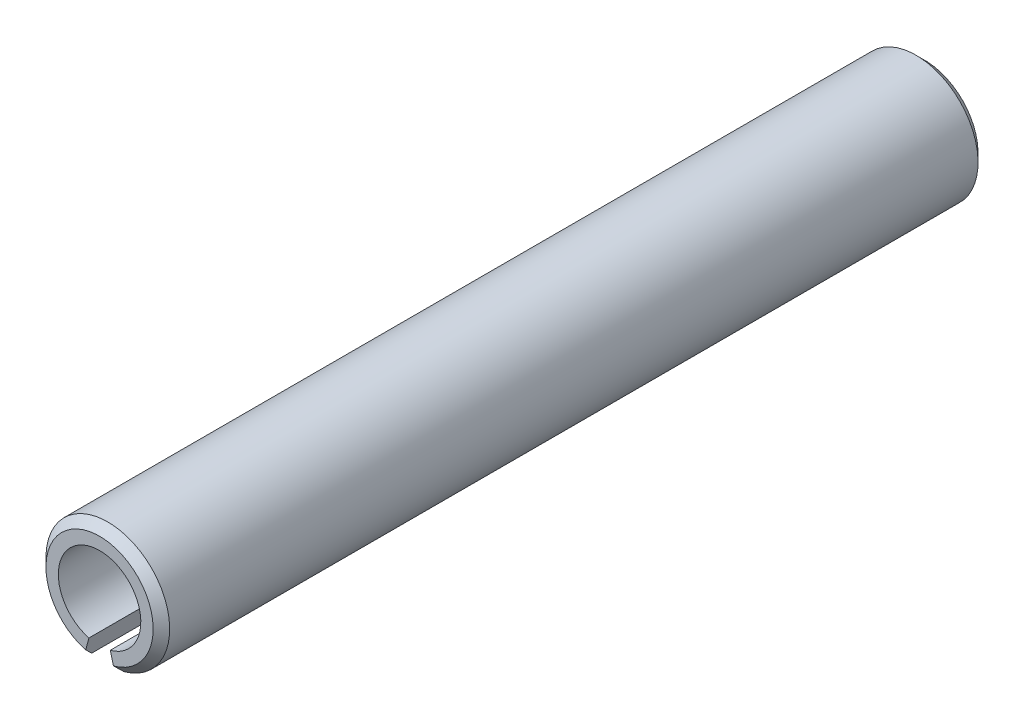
ISO-10303-21;
HEADER;
FILE_DESCRIPTION(('STEP AP214'),'2;1');
FILE_NAME('part.step','',(''),(''),'','','');
FILE_SCHEMA(('AUTOMOTIVE_DESIGN { 1 0 10303 214 1 1 1 1 }'));
ENDSEC;
DATA;
#1=APPLICATION_CONTEXT('core data for automotive mechanical design processes');
#2=APPLICATION_PROTOCOL_DEFINITION('international standard','automotive_design',2000,#1);
#3=PRODUCT_CONTEXT('',#1,'mechanical');
#4=PRODUCT('Part','Part','',(#3));
#5=PRODUCT_RELATED_PRODUCT_CATEGORY('part','',(#4));
#6=PRODUCT_DEFINITION_FORMATION('','',#4);
#7=PRODUCT_DEFINITION_CONTEXT('part definition',#1,'design');
#8=PRODUCT_DEFINITION('design','',#6,#7);
#9=PRODUCT_DEFINITION_SHAPE('','',#8);
#10=(LENGTH_UNIT() NAMED_UNIT(*) SI_UNIT(.MILLI.,.METRE.));
#11=(NAMED_UNIT(*) PLANE_ANGLE_UNIT() SI_UNIT($,.RADIAN.));
#12=(NAMED_UNIT(*) SI_UNIT($,.STERADIAN.) SOLID_ANGLE_UNIT());
#13=UNCERTAINTY_MEASURE_WITH_UNIT(LENGTH_MEASURE(1.E-05),#10,'distance_accuracy_value','');
#14=(GEOMETRIC_REPRESENTATION_CONTEXT(3) GLOBAL_UNCERTAINTY_ASSIGNED_CONTEXT((#13)) GLOBAL_UNIT_ASSIGNED_CONTEXT((#10,
#11,#12)) REPRESENTATION_CONTEXT('',''));
#15=CARTESIAN_POINT('',(0.,0.,0.));
#16=DIRECTION('',(0.,0.,1.));
#17=DIRECTION('',(1.,0.,0.));
#18=AXIS2_PLACEMENT_3D('',#15,#16,#17);
#19=CARTESIAN_POINT('',(0.,0.,20.));
#20=DIRECTION('',(0.,0.,-1.));
#21=DIRECTION('',(-1.,0.,0.));
#22=AXIS2_PLACEMENT_3D('',#19,#20,#21);
#23=CYLINDRICAL_SURFACE('',#22,1.5);
#24=DIRECTION('',(0.,0.,-1.));
#25=VECTOR('',#24,1.);
#26=CARTESIAN_POINT('',(-0.388228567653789,-1.44888873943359,20.));
#27=LINE('',#26,#25);
#28=CARTESIAN_POINT('',(-0.388228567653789,-1.44888873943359,19.8));
#29=VERTEX_POINT('',#28);
#30=CARTESIAN_POINT('',(-0.388228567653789,-1.44888873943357,0.199999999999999));
#31=VERTEX_POINT('',#30);
#32=EDGE_CURVE('E426',#29,#31,#27,.T.);
#33=ORIENTED_EDGE('',*,*,#32,.F.);
#34=CARTESIAN_POINT('',(0.,0.,19.8));
#35=DIRECTION('',(0.,0.,1.));
#36=DIRECTION('',(1.,0.,0.));
#37=AXIS2_PLACEMENT_3D('',#34,#35,#36);
#38=CIRCLE('',#37,1.5);
#39=CARTESIAN_POINT('',(0.388228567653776,-1.44888873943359,19.8));
#40=VERTEX_POINT('',#39);
#41=EDGE_CURVE('E453',#29,#40,#38,.F.);
#42=ORIENTED_EDGE('',*,*,#41,.T.);
#43=DIRECTION('',(0.,0.,-1.));
#44=VECTOR('',#43,1.);
#45=CARTESIAN_POINT('',(0.388228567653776,-1.44888873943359,20.));
#46=LINE('',#45,#44);
#47=CARTESIAN_POINT('',(0.388228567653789,-1.44888873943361,0.200000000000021));
#48=VERTEX_POINT('',#47);
#49=EDGE_CURVE('E440',#40,#48,#46,.T.);
#50=ORIENTED_EDGE('',*,*,#49,.T.);
#51=CARTESIAN_POINT('',(0.,0.,0.200000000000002));
#52=DIRECTION('',(0.,0.,1.));
#53=DIRECTION('',(1.,0.,0.));
#54=AXIS2_PLACEMENT_3D('',#51,#52,#53);
#55=CIRCLE('',#54,1.5);
#56=EDGE_CURVE('E450',#48,#31,#55,.T.);
#57=ORIENTED_EDGE('',*,*,#56,.T.);
#58=EDGE_LOOP('',(#33,#42,#50,#57));
#59=FACE_BOUND('',#58,.T.);
#60=ADVANCED_FACE('F358',(#59),#23,.T.);
#61=CARTESIAN_POINT('',(-0.25881904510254,-0.965925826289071,20.));
#62=DIRECTION('',(-0.965925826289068,0.25881904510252,0.));
#63=DIRECTION('',(-0.258819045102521,-0.965925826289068,0.));
#64=AXIS2_PLACEMENT_3D('',#61,#62,#63);
#65=PLANE('',#64);
#66=DIRECTION('',(0.258819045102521,0.965925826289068,0.));
#67=VECTOR('',#66,1.);
#68=CARTESIAN_POINT('',(-0.25881904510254,-0.965925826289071,20.));
#69=LINE('',#68,#67);
#70=CARTESIAN_POINT('',(-0.336464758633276,-1.25570357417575,20.));
#71=VERTEX_POINT('',#70);
#72=CARTESIAN_POINT('',(-0.25881904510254,-0.965925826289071,20.));
#73=VERTEX_POINT('',#72);
#74=EDGE_CURVE('E432',#71,#73,#69,.T.);
#75=ORIENTED_EDGE('',*,*,#74,.F.);
#76=DIRECTION('',(0.18301270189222,0.683012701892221,0.707106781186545));
#77=VECTOR('',#76,1.);
#78=CARTESIAN_POINT('',(0.,0.,21.3));
#79=LINE('',#78,#77);
#80=EDGE_CURVE('E448',#71,#29,#79,.F.);
#81=ORIENTED_EDGE('',*,*,#80,.T.);
#82=ORIENTED_EDGE('',*,*,#32,.T.);
#83=DIRECTION('',(-0.18301270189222,-0.683012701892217,0.707106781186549));
#84=VECTOR('',#83,1.);
#85=CARTESIAN_POINT('',(0.,0.,-1.3));
#86=LINE('',#85,#84);
#87=CARTESIAN_POINT('',(-0.336464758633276,-1.25570357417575,0.));
#88=VERTEX_POINT('',#87);
#89=EDGE_CURVE('E417',#31,#88,#86,.F.);
#90=ORIENTED_EDGE('',*,*,#89,.T.);
#91=DIRECTION('',(0.258819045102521,0.965925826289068,0.));
#92=VECTOR('',#91,1.);
#93=CARTESIAN_POINT('',(-0.25881904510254,-0.965925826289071,0.));
#94=LINE('',#93,#92);
#95=CARTESIAN_POINT('',(-0.25881904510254,-0.965925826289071,0.));
#96=VERTEX_POINT('',#95);
#97=EDGE_CURVE('E410',#88,#96,#94,.T.);
#98=ORIENTED_EDGE('',*,*,#97,.T.);
#99=DIRECTION('',(0.,0.,-1.));
#100=VECTOR('',#99,1.);
#101=CARTESIAN_POINT('',(-0.25881904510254,-0.965925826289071,20.));
#102=LINE('',#101,#100);
#103=EDGE_CURVE('E414',#73,#96,#102,.T.);
#104=ORIENTED_EDGE('',*,*,#103,.F.);
#105=EDGE_LOOP('',(#75,#81,#82,#90,#98,#104));
#106=FACE_BOUND('',#105,.T.);
#107=ADVANCED_FACE('F413',(#106),#65,.F.);
#108=CARTESIAN_POINT('',(0.,0.,20.));
#109=DIRECTION('',(0.,0.,-1.));
#110=DIRECTION('',(-1.,0.,0.));
#111=AXIS2_PLACEMENT_3D('',#108,#109,#110);
#112=CYLINDRICAL_SURFACE('',#111,1.);
#113=CARTESIAN_POINT('',(0.,0.,0.));
#114=DIRECTION('',(0.,0.,-1.));
#115=DIRECTION('',(1.,0.,0.));
#116=AXIS2_PLACEMENT_3D('',#113,#114,#115);
#117=CIRCLE('',#116,1.);
#118=CARTESIAN_POINT('',(0.258819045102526,-0.965925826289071,0.));
#119=VERTEX_POINT('',#118);
#120=EDGE_CURVE('E419',#96,#119,#117,.T.);
#121=ORIENTED_EDGE('',*,*,#120,.T.);
#122=DIRECTION('',(0.,0.,-1.));
#123=VECTOR('',#122,1.);
#124=CARTESIAN_POINT('',(0.258819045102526,-0.965925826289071,20.));
#125=LINE('',#124,#123);
#126=CARTESIAN_POINT('',(0.258819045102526,-0.965925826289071,20.));
#127=VERTEX_POINT('',#126);
#128=EDGE_CURVE('E427',#127,#119,#125,.T.);
#129=ORIENTED_EDGE('',*,*,#128,.F.);
#130=CARTESIAN_POINT('',(0.,0.,20.));
#131=DIRECTION('',(0.,0.,-1.));
#132=DIRECTION('',(1.,0.,0.));
#133=AXIS2_PLACEMENT_3D('',#130,#131,#132);
#134=CIRCLE('',#133,1.);
#135=EDGE_CURVE('E425',#73,#127,#134,.T.);
#136=ORIENTED_EDGE('',*,*,#135,.F.);
#137=ORIENTED_EDGE('',*,*,#103,.T.);
#138=EDGE_LOOP('',(#121,#129,#136,#137));
#139=FACE_BOUND('',#138,.T.);
#140=ADVANCED_FACE('F422',(#139),#112,.F.);
#141=CARTESIAN_POINT('',(0.258819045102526,-0.965925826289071,20.));
#142=DIRECTION('',(0.965925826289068,0.258819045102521,0.));
#143=DIRECTION('',(-0.258819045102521,0.965925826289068,0.));
#144=AXIS2_PLACEMENT_3D('',#141,#142,#143);
#145=PLANE('',#144);
#146=ORIENTED_EDGE('',*,*,#49,.F.);
#147=DIRECTION('',(0.18301270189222,-0.683012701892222,-0.707106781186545));
#148=VECTOR('',#147,1.);
#149=CARTESIAN_POINT('',(0.,0.,21.3));
#150=LINE('',#149,#148);
#151=CARTESIAN_POINT('',(0.336464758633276,-1.25570357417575,20.));
#152=VERTEX_POINT('',#151);
#153=EDGE_CURVE('E365',#40,#152,#150,.F.);
#154=ORIENTED_EDGE('',*,*,#153,.T.);
#155=DIRECTION('',(0.258819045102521,-0.965925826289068,0.));
#156=VECTOR('',#155,1.);
#157=CARTESIAN_POINT('',(0.258819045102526,-0.965925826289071,20.));
#158=LINE('',#157,#156);
#159=EDGE_CURVE('E437',#127,#152,#158,.T.);
#160=ORIENTED_EDGE('',*,*,#159,.F.);
#161=ORIENTED_EDGE('',*,*,#128,.T.);
#162=DIRECTION('',(0.258819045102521,-0.965925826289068,0.));
#163=VECTOR('',#162,1.);
#164=CARTESIAN_POINT('',(0.258819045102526,-0.965925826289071,0.));
#165=LINE('',#164,#163);
#166=CARTESIAN_POINT('',(0.336464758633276,-1.2557035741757,0.));
#167=VERTEX_POINT('',#166);
#168=EDGE_CURVE('E430',#119,#167,#165,.T.);
#169=ORIENTED_EDGE('',*,*,#168,.T.);
#170=DIRECTION('',(-0.183012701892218,0.683012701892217,-0.707106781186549));
#171=VECTOR('',#170,1.);
#172=CARTESIAN_POINT('',(0.,0.,-1.3));
#173=LINE('',#172,#171);
#174=EDGE_CURVE('E377',#167,#48,#173,.F.);
#175=ORIENTED_EDGE('',*,*,#174,.T.);
#176=EDGE_LOOP('',(#146,#154,#160,#161,#169,#175));
#177=FACE_BOUND('',#176,.T.);
#178=ADVANCED_FACE('F457',(#177),#145,.F.);
#179=CARTESIAN_POINT('',(0.,0.,20.));
#180=DIRECTION('',(0.,0.,1.));
#181=DIRECTION('',(1.,0.,0.));
#182=AXIS2_PLACEMENT_3D('',#179,#180,#181);
#183=PLANE('',#182);
#184=ORIENTED_EDGE('',*,*,#159,.T.);
#185=CARTESIAN_POINT('',(0.,0.,20.));
#186=DIRECTION('',(0.,0.,1.));
#187=DIRECTION('',(1.,0.,0.));
#188=AXIS2_PLACEMENT_3D('',#185,#186,#187);
#189=CIRCLE('',#188,1.3);
#190=EDGE_CURVE('E444',#152,#71,#189,.T.);
#191=ORIENTED_EDGE('',*,*,#190,.T.);
#192=ORIENTED_EDGE('',*,*,#74,.T.);
#193=ORIENTED_EDGE('',*,*,#135,.T.);
#194=EDGE_LOOP('',(#184,#191,#192,#193));
#195=FACE_BOUND('',#194,.T.);
#196=ADVANCED_FACE('F462',(#195),#183,.T.);
#197=CARTESIAN_POINT('',(0.,0.,0.));
#198=DIRECTION('',(0.,0.,1.));
#199=DIRECTION('',(1.,0.,0.));
#200=AXIS2_PLACEMENT_3D('',#197,#198,#199);
#201=PLANE('',#200);
#202=ORIENTED_EDGE('',*,*,#97,.F.);
#203=CARTESIAN_POINT('',(0.,0.,0.));
#204=DIRECTION('',(0.,0.,1.));
#205=DIRECTION('',(1.,0.,0.));
#206=AXIS2_PLACEMENT_3D('',#203,#204,#205);
#207=CIRCLE('',#206,1.3);
#208=EDGE_CURVE('E13',#88,#167,#207,.F.);
#209=ORIENTED_EDGE('',*,*,#208,.T.);
#210=ORIENTED_EDGE('',*,*,#168,.F.);
#211=ORIENTED_EDGE('',*,*,#120,.F.);
#212=EDGE_LOOP('',(#202,#209,#210,#211));
#213=FACE_BOUND('',#212,.T.);
#214=ADVANCED_FACE('F429',(#213),#201,.F.);
#215=CARTESIAN_POINT('',(0.,0.,20.));
#216=DIRECTION('',(0.,0.,-1.));
#217=DIRECTION('',(-1.,0.,0.));
#218=AXIS2_PLACEMENT_3D('',#215,#216,#217);
#219=CONICAL_SURFACE('',#218,1.3,0.785398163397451);
#220=ORIENTED_EDGE('',*,*,#153,.F.);
#221=ORIENTED_EDGE('',*,*,#41,.F.);
#222=ORIENTED_EDGE('',*,*,#80,.F.);
#223=ORIENTED_EDGE('',*,*,#190,.F.);
#224=EDGE_LOOP('',(#220,#221,#222,#223));
#225=FACE_BOUND('',#224,.T.);
#226=ADVANCED_FACE('F463',(#225),#219,.T.);
#227=CARTESIAN_POINT('',(0.,0.,0.200000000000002));
#228=DIRECTION('',(0.,0.,1.));
#229=DIRECTION('',(1.,0.,0.));
#230=AXIS2_PLACEMENT_3D('',#227,#228,#229);
#231=CONICAL_SURFACE('',#230,1.5,0.785398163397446);
#232=ORIENTED_EDGE('',*,*,#174,.F.);
#233=ORIENTED_EDGE('',*,*,#208,.F.);
#234=ORIENTED_EDGE('',*,*,#89,.F.);
#235=ORIENTED_EDGE('',*,*,#56,.F.);
#236=EDGE_LOOP('',(#232,#233,#234,#235));
#237=FACE_BOUND('',#236,.T.);
#238=ADVANCED_FACE('F468',(#237),#231,.T.);
#239=CLOSED_SHELL('',(#60,#107,#140,#178,#196,#214,#226,#238));
#240=MANIFOLD_SOLID_BREP('B2',#239);
#241=ADVANCED_BREP_SHAPE_REPRESENTATION('',(#18,#240),#14);
#242=SHAPE_DEFINITION_REPRESENTATION(#9,#241);
ENDSEC;
END-ISO-10303-21;
